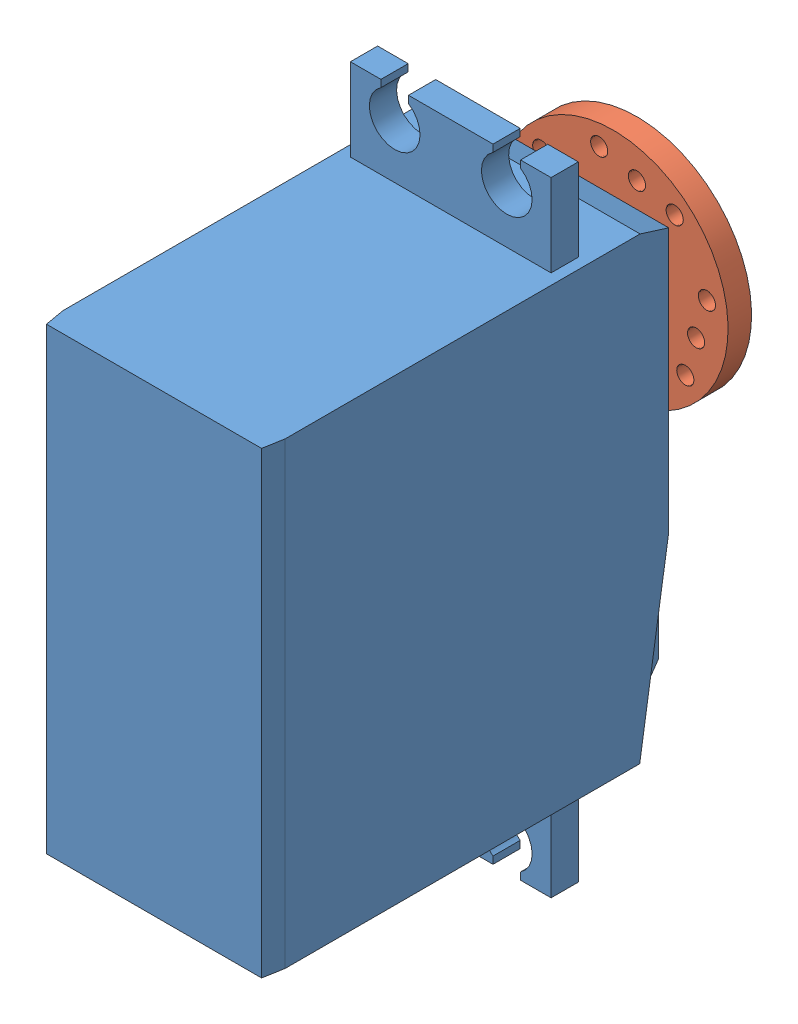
SolidWorks assembly Servo Assembly Futaba S3003.SLDASM, configuration Default (file format 4400). Lengths in mm.
Overall size (25.15 55.27 44.82).
3 component instances, 3 part files, 3 mates.
Components (placement in the parent):
- Servo Futaba S3003-1: Servo Futaba S3003.SLDPRT [Default] at (2.0138 6.4103 -5.4178) size (19.69 55.27 37.39)
- Servo Rotor-1: Servo Rotor.SLDPRT [Default] at (2.0138 15.8718 -10.3454) x (0.2747 0.96153 0) z (0 0 -1) size (20.35 20.35 16.65)
- Servo Spindle-1: Servo Spindle.SLDPRT [Default] at (2.0138 15.8718 -12.9521) x (0.060818 -0.998149 0) z (0 0 1) size (5.97 5.97 20.67)
Mates (geometry in assembly coordinates):
- Concentric1: concentric aligned: cylinder of Servo Futaba S3003-1 through (2.0138 15.8718 2.9566) axis (0 0 -1) radius 2.9591; cylinder of Servo Spindle-1 through (2.0138 15.8718 6.1919) axis (0 0 -1) radius 1.2192
- Concentric2: concentric aligned: cylinder of Servo Rotor-1 through (2.0138 15.8718 4.2266) axis (0 0 -1) radius 1.27; cylinder of Servo Spindle-1 through (2.0138 15.8718 6.1919) axis (0 0 -1) radius 1.2192
- Coincident6: coincident anti-aligned: plane of Servo Futaba S3003-1 through (2.0138 15.8718 -7.0434) normal (0 0 -1); plane of Servo Rotor-1 through (2.0138 15.8718 -7.0434) normal (0 0 1)
